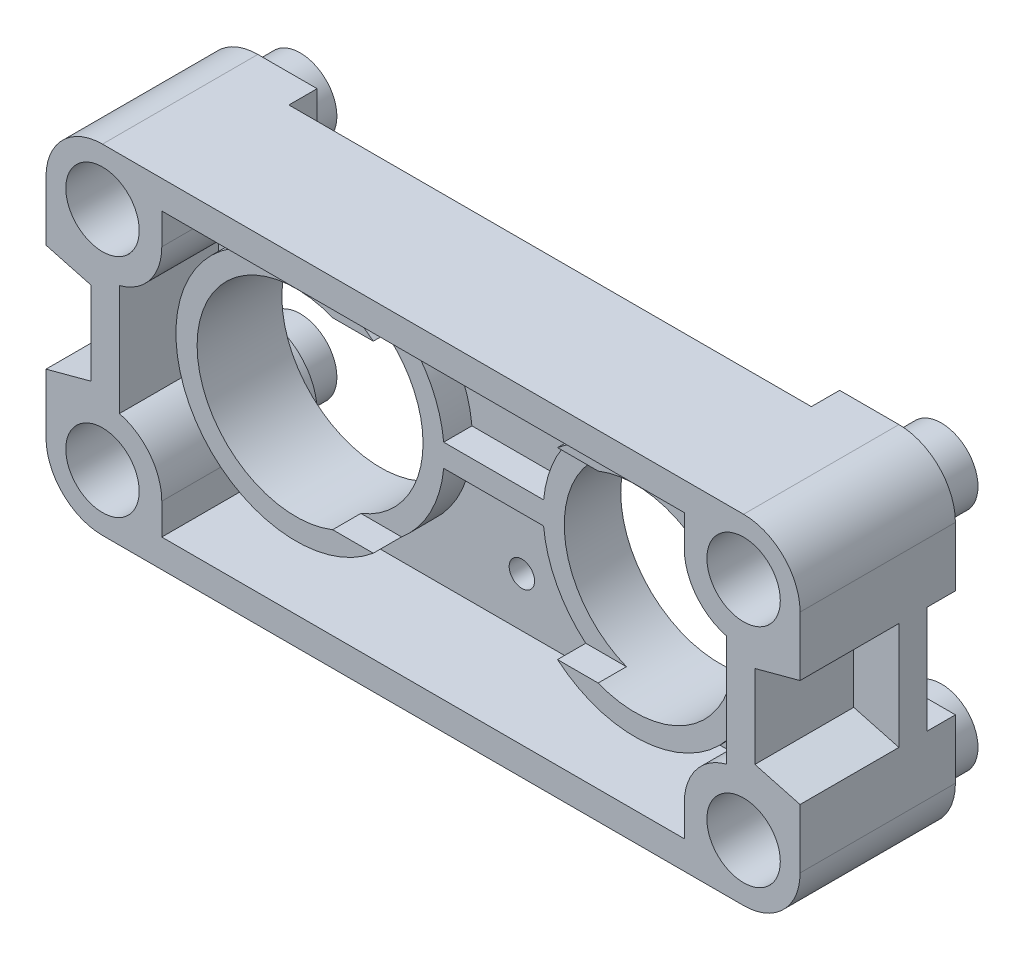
from build123d import *

# Parameters (mm, degrees)
EXTRUSION1_DEPTH        = 1
EXTRUSION1_2_DEPTH      = 1
EXTRUSION1_3_DEPTH      = 1
EXTRUSION1_4_DEPTH      = 1
EXTRUSION2_DEPTH        = 1
EXTRUSION7_DEPTH        = 1
EXTRUSION3_DEPTH        = 4.5
ESQUISSE3_R             = 1.3
EXTRUSION5_DEPTH        = 1.5
ESQUISSE4_R             = 1.3
ENL_V_MAT_EXTRU_1_DEPTH = 2
ESQUISSE5_R             = 3.5
ESQUISSE5_R_2           = 0.45
ESQUISSE5_R_3           = 0.75
ENL_V_MAT_EXTRU_2_DEPTH = 17.224133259
EXTRUSION6_START        = 2
ESQUISSE6_R             = 3.5
EXTRUSION6_DEPTH        = 2
ESQUISSE7_W             = 10.8
ESQUISSE7_H             = 6.5
ENL_V_MAT_EXTRU_3_DEPTH = 1


with BuildPart() as part:
    # Esquisse1 → Extrusion1 (new body)
    with BuildSketch(Plane.XY):
        with BuildLine():
            Line((13.35, 1.9), (13.35, 4))
            ThreePointArc((13.35, 4), (12.764213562, 5.414213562), (11.35, 6))
            Line((11.35, 6), (9.25, 6))
            Line((9.25, 6), (9.25, 3.9))
            ThreePointArc((9.25, 3.9), (9.835786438, 2.485786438), (11.25, 1.9))
            Line((11.25, 1.9), (13.35, 1.9))
        make_face()
    extrude(amount=EXTRUSION1_DEPTH)



with BuildPart() as body_2:
    # Esquisse1 → Extrusion1 2 (new body)
    with BuildSketch(Plane.XY):
        with BuildLine():
            Line((-9.25, 6), (-11.35, 6))
            ThreePointArc((-11.35, 6), (-12.764213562, 5.414213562), (-13.35, 4))
            Line((-13.35, 4), (-13.35, 1.9))
            Line((-13.35, 1.9), (-11.25, 1.9))
            ThreePointArc((-11.25, 1.9), (-9.835786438, 2.485786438), (-9.25, 3.9))
            Line((-9.25, 3.9), (-9.25, 6))
        make_face()
    extrude(amount=EXTRUSION1_2_DEPTH)


with BuildPart() as body_3:
    # Esquisse1 → Extrusion1 3 (new body)
    with BuildSketch(Plane.XY):
        with BuildLine():
            Line((9.25, -6), (11.35, -6))
            ThreePointArc((11.35, -6), (12.764213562, -5.414213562), (13.35, -4))
            Line((13.35, -4), (13.35, -1.9))
            Line((13.35, -1.9), (11.25, -1.9))
            ThreePointArc((11.25, -1.9), (9.835786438, -2.485786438), (9.25, -3.9))
            Line((9.25, -3.9), (9.25, -6))
        make_face()
    extrude(amount=EXTRUSION1_3_DEPTH)


with BuildPart() as body_4:
    # Esquisse1 → Extrusion1 4 (new body)
    with BuildSketch(Plane.XY):
        with BuildLine():
            Line((-11.25, -1.9), (-13.35, -1.9))
            Line((-13.35, -1.9), (-13.35, -4))
            ThreePointArc((-13.35, -4), (-12.764213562, -5.414213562), (-11.35, -6))
            Line((-11.35, -6), (-9.25, -6))
            Line((-9.25, -6), (-9.25, -3.9))
            ThreePointArc((-9.25, -3.9), (-9.835786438, -2.485786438), (-11.25, -1.9))
        make_face()
    extrude(amount=EXTRUSION1_4_DEPTH)


with BuildPart() as part_1:
    add(part.part)

    add(body_2.part)  # Extrusion2 merges body 2

    add(body_3.part)  # Extrusion2 merges body 3

    add(body_4.part)  # Extrusion2 merges body 4
    # Esquisse2 → Extrusion2 (add)
    with BuildSketch(Plane.XY.offset(1)):
        with BuildLine():
            Line((-11.75, -1.471281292), (-13.35, -1.9))
            Line((-13.35, -1.9), (-13.35, -4))
            ThreePointArc((-13.35, -4), (-12.764213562, -5.414213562), (-11.35, -6))
            Line((-11.35, -6), (11.35, -6))
            ThreePointArc((11.35, -6), (12.764213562, -5.414213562), (13.35, -4))
            Line((13.35, -4), (13.35, -1.9))
            Line((13.35, -1.9), (11.75, -1.471281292))
            Line((11.75, -1.471281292), (11.75, 1.471281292))
            Line((11.75, 1.471281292), (13.35, 1.9))
            Line((13.35, 1.9), (13.35, 4))
            ThreePointArc((13.35, 4), (12.764213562, 5.414213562), (11.35, 6))
            Line((11.35, 6), (-11.35, 6))
            ThreePointArc((-11.35, 6), (-12.764213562, 5.414213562), (-13.35, 4))
            Line((-13.35, 4), (-13.35, 1.9))
            Line((-13.35, 1.9), (-11.75, 1.471281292))
            Line((-11.75, 1.471281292), (-11.75, -1.471281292))
        make_face()
    extrude(amount=EXTRUSION2_DEPTH)

    # Esquisse8 → Extrusion7 (add)
    with BuildSketch(Plane.XY.offset(2)):
        Polygon((11.75, 1.471281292), (11.75, -1.471281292), (13.35, -1.9), (13.35, 1.9), align=None)
        Polygon((-11.75, -1.471281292), (-13.35, -1.9), (-13.35, 1.9), (-11.75, 1.471281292), align=None)
    extrude(amount=-EXTRUSION7_DEPTH)

    # Esquisse2_3 → Extrusion3 (add)
    with BuildSketch(Plane.XY.offset(1)):
        with BuildLine():
            Line((-11.75, -1.471281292), (-13.35, -1.9))
            Line((-13.35, -1.9), (-13.35, -4))
            ThreePointArc((-13.35, -4), (-12.764213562, -5.414213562), (-11.35, -6))
            Line((-11.35, -6), (11.35, -6))
            ThreePointArc((11.35, -6), (12.764213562, -5.414213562), (13.35, -4))
            Line((13.35, -4), (13.35, -1.9))
            Line((13.35, -1.9), (11.75, -1.471281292))
            Line((11.75, -1.471281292), (11.75, 1.471281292))
            Line((11.75, 1.471281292), (13.35, 1.9))
            Line((13.35, 1.9), (13.35, 4))
            ThreePointArc((13.35, 4), (12.764213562, 5.414213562), (11.35, 6))
            Line((11.35, 6), (-11.35, 6))
            ThreePointArc((-11.35, 6), (-12.764213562, 5.414213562), (-13.35, 4))
            Line((-13.35, 4), (-13.35, 1.9))
            Line((-13.35, 1.9), (-11.75, 1.471281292))
            Line((-11.75, 1.471281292), (-11.75, -1.471281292))
        make_face()
        with BuildLine():
            Line((-10.75, 1.963508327), (-10.75, -1.963508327))
            ThreePointArc((-10.75, -1.963508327), (-9.66886117, -2.675255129), (-9.25, -3.9))
            Line((-9.25, -3.9), (-9.25, -5))
            Line((-9.25, -5), (9.25, -5))
            Line((9.25, -5), (9.25, -3.9))
            ThreePointArc((9.25, -3.9), (9.66886117, -2.675255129), (10.75, -1.963508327))
            Line((10.75, -1.963508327), (10.75, 1.963508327))
            ThreePointArc((10.75, 1.963508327), (9.66886117, 2.675255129), (9.25, 3.9))
            Line((9.25, 3.9), (9.25, 5))
            Line((9.25, 5), (-9.25, 5))
            Line((-9.25, 5), (-9.25, 3.9))
            ThreePointArc((-9.25, 3.9), (-9.66886117, 2.675255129), (-10.75, 1.963508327))
        make_face(mode=Mode.SUBTRACT)
    extrude(amount=EXTRUSION3_DEPTH)

    # Esquisse3 → Extrusion5 (add)
    with BuildSketch(Plane(origin=(0, 0, 0), x_dir=(-1, 0, 0), z_dir=(0, 0, -1))):
        with Locations(Location((-11.35, 4, 0), (0, 0, 180))):
            Circle(ESQUISSE3_R)
        with Locations(Location((11.35, 4, 0), (0, 0, 180))):
            Circle(ESQUISSE3_R)
        with Locations(Location((-11.35, -4, 0), (0, 0, 180))):
            Circle(ESQUISSE3_R)
        with Locations(Location((11.35, -4, 0), (0, 0, 180))):
            Circle(ESQUISSE3_R)
    extrude(amount=EXTRUSION5_DEPTH)

    # Esquisse4 → Enl_v. mat.-Extru.1 (cut)
    with BuildSketch(Plane.XY.offset(5.5)):
        with Locations((11.35, 4)):
            Circle(ESQUISSE4_R)
        with Locations((11.35, -4)):
            Circle(ESQUISSE4_R)
        with Locations((-11.35, -4)):
            Circle(ESQUISSE4_R)
        with Locations((-11.35, 4)):
            Circle(ESQUISSE4_R)
    extrude(amount=-ENL_V_MAT_EXTRU_1_DEPTH, mode=Mode.SUBTRACT)

    # Esquisse5 → Enl_v. mat.-Extru.2 (cut, through all)
    with BuildSketch(Plane.XY.offset(5.5)):
        with Locations((-6, 0)):
            Circle(ESQUISSE5_R)
        with Locations((6, 0)):
            Circle(ESQUISSE5_R)
        with Locations((0, 3.25)):
            Circle(ESQUISSE5_R_2)
        with Locations((0, -3.25)):
            Circle(ESQUISSE5_R_2)
        with Locations((-11.35, 4)):
            Circle(ESQUISSE5_R_3)
        with Locations((-11.35, -4)):
            Circle(ESQUISSE5_R_3)
        with Locations((11.35, -4)):
            Circle(ESQUISSE5_R_3)
        with Locations((11.35, 4)):
            Circle(ESQUISSE5_R_3)
    extrude(amount=-ENL_V_MAT_EXTRU_2_DEPTH, mode=Mode.SUBTRACT)

    # Esquisse6 → Extrusion6 (add)
    with BuildSketch(Plane.XY.offset(2).offset(EXTRUSION6_START)):
        with BuildLine():
            Line((-1.7688654, 0.4), (1.7688654, 0.4))
            ThreePointArc((1.7688654, 0.4), (10.25, 0), (1.7688654, -0.4))
            Line((1.7688654, -0.4), (-1.7688654, -0.4))
            ThreePointArc((-1.7688654, -0.4), (-10.25, 0), (-1.7688654, 0.4))
        make_face()
        with Locations((6, 0)):
            Circle(ESQUISSE6_R, mode=Mode.SUBTRACT)
        with Locations((-6, 0)):
            Circle(ESQUISSE6_R, mode=Mode.SUBTRACT)
    extrude(amount=-EXTRUSION6_DEPTH)

    # Esquisse7 → Enl_v. mat.-Extru.3 (cut)
    with BuildSketch(Plane.XY.offset(4)):
        Rectangle(ESQUISSE7_W, ESQUISSE7_H)
    extrude(amount=-ENL_V_MAT_EXTRU_3_DEPTH, mode=Mode.SUBTRACT)


solid = part_1.part
